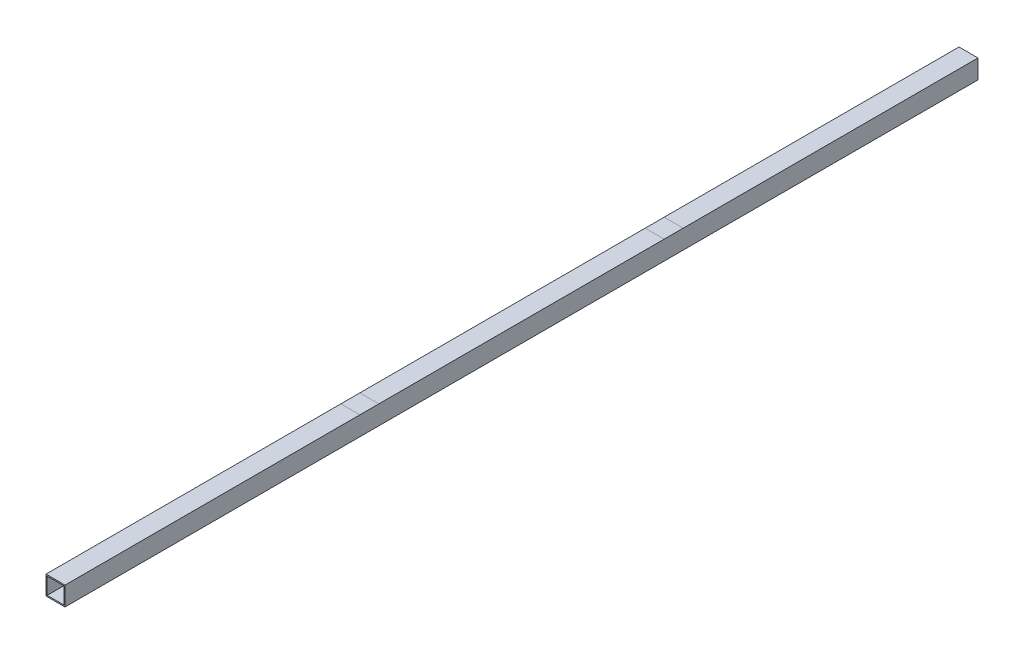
from build123d import *

# Parameters (mm, degrees)
ESQUISSE1_W        = 80
ESQUISSE1_H        = 80
ESQUISSE1_W_2      = 70
ESQUISSE1_H_2      = 70
BOSS_EXTRU_1_DEPTH = 3840


with BuildPart() as part:
    # Esquisse1 → Boss.-Extru.1 (new body)
    with BuildSketch(Plane.XY):
        Rectangle(ESQUISSE1_W, ESQUISSE1_H)
        Rectangle(ESQUISSE1_W_2, ESQUISSE1_H_2, mode=Mode.SUBTRACT)
    extrude(amount=BOSS_EXTRU_1_DEPTH)


solid = part.part
